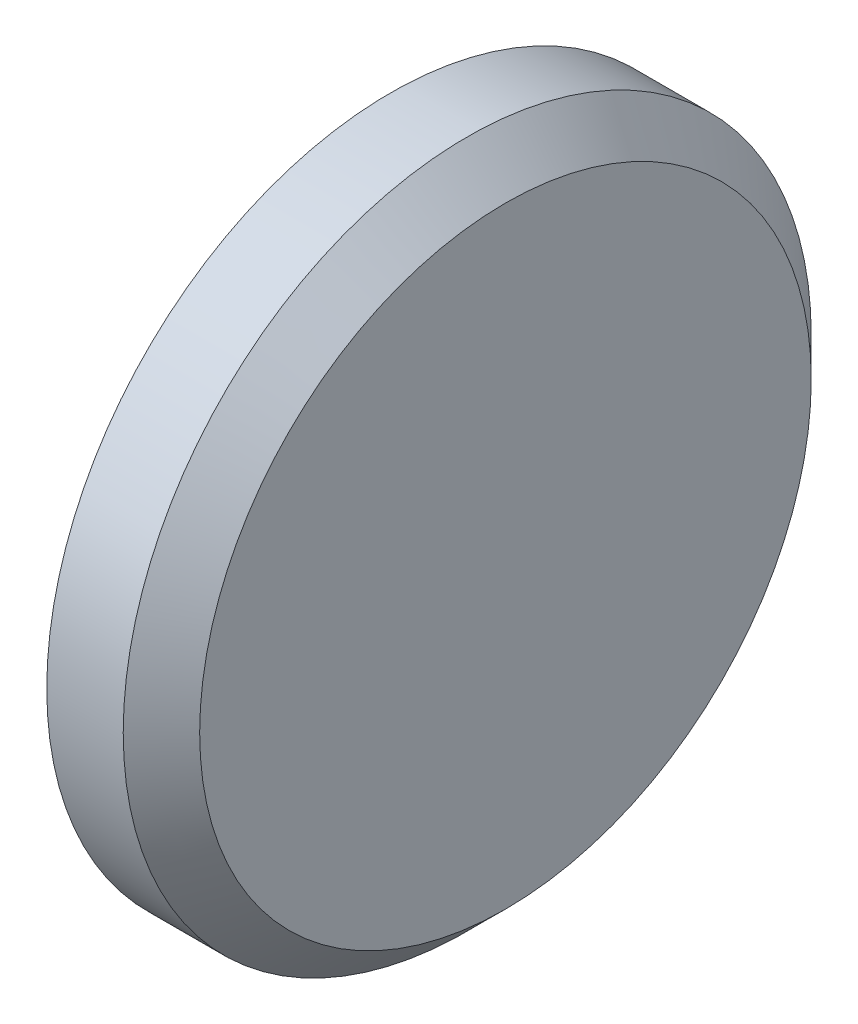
ISO-10303-21;
HEADER;
FILE_DESCRIPTION(('STEP AP214'),'2;1');
FILE_NAME('part.step','',(''),(''),'','','');
FILE_SCHEMA(('AUTOMOTIVE_DESIGN { 1 0 10303 214 1 1 1 1 }'));
ENDSEC;
DATA;
#1=APPLICATION_CONTEXT('core data for automotive mechanical design processes');
#2=APPLICATION_PROTOCOL_DEFINITION('international standard','automotive_design',2000,#1);
#3=PRODUCT_CONTEXT('',#1,'mechanical');
#4=PRODUCT('Part','Part','',(#3));
#5=PRODUCT_RELATED_PRODUCT_CATEGORY('part','',(#4));
#6=PRODUCT_DEFINITION_FORMATION('','',#4);
#7=PRODUCT_DEFINITION_CONTEXT('part definition',#1,'design');
#8=PRODUCT_DEFINITION('design','',#6,#7);
#9=PRODUCT_DEFINITION_SHAPE('','',#8);
#10=(LENGTH_UNIT() NAMED_UNIT(*) SI_UNIT(.MILLI.,.METRE.));
#11=(NAMED_UNIT(*) PLANE_ANGLE_UNIT() SI_UNIT($,.RADIAN.));
#12=(NAMED_UNIT(*) SI_UNIT($,.STERADIAN.) SOLID_ANGLE_UNIT());
#13=UNCERTAINTY_MEASURE_WITH_UNIT(LENGTH_MEASURE(1.E-05),#10,'distance_accuracy_value','');
#14=(GEOMETRIC_REPRESENTATION_CONTEXT(3) GLOBAL_UNCERTAINTY_ASSIGNED_CONTEXT((#13)) GLOBAL_UNIT_ASSIGNED_CONTEXT((#10,
#11,#12)) REPRESENTATION_CONTEXT('',''));
#15=CARTESIAN_POINT('',(0.,0.,0.));
#16=DIRECTION('',(0.,0.,1.));
#17=DIRECTION('',(1.,0.,0.));
#18=AXIS2_PLACEMENT_3D('',#15,#16,#17);
#19=CARTESIAN_POINT('',(3.,0.,0.));
#20=DIRECTION('',(-1.,0.,0.));
#21=DIRECTION('',(0.,0.,1.));
#22=AXIS2_PLACEMENT_3D('',#19,#20,#21);
#23=CYLINDRICAL_SURFACE('',#22,9.);
#24=CARTESIAN_POINT('',(1.99999999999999,0.,0.));
#25=DIRECTION('',(1.,0.,0.));
#26=DIRECTION('',(0.,0.,-1.));
#27=AXIS2_PLACEMENT_3D('',#24,#25,#26);
#28=CIRCLE('',#27,9.);
#29=CARTESIAN_POINT('',(1.99999999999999,0.,-9.));
#30=VERTEX_POINT('',#29);
#31=EDGE_CURVE('E10',#30,#30,#28,.F.);
#32=ORIENTED_EDGE('',*,*,#31,.T.);
#33=EDGE_LOOP('',(#32));
#34=FACE_BOUND('',#33,.T.);
#35=CARTESIAN_POINT('',(0.,0.,0.));
#36=DIRECTION('',(1.,0.,0.));
#37=DIRECTION('',(0.,0.,-1.));
#38=AXIS2_PLACEMENT_3D('',#35,#36,#37);
#39=CIRCLE('',#38,9.);
#40=CARTESIAN_POINT('',(0.,0.,-9.));
#41=VERTEX_POINT('',#40);
#42=EDGE_CURVE('E42',#41,#41,#39,.T.);
#43=ORIENTED_EDGE('',*,*,#42,.T.);
#44=EDGE_LOOP('',(#43));
#45=FACE_BOUND('',#44,.T.);
#46=ADVANCED_FACE('F31',(#34,#45),#23,.T.);
#47=CARTESIAN_POINT('',(3.,0.,0.));
#48=DIRECTION('',(1.,0.,0.));
#49=DIRECTION('',(0.,0.,-1.));
#50=AXIS2_PLACEMENT_3D('',#47,#48,#49);
#51=PLANE('',#50);
#52=CARTESIAN_POINT('',(3.,0.,0.));
#53=DIRECTION('',(1.,0.,0.));
#54=DIRECTION('',(0.,0.,-1.));
#55=AXIS2_PLACEMENT_3D('',#52,#53,#54);
#56=CIRCLE('',#55,8.);
#57=CARTESIAN_POINT('',(3.,0.,-8.));
#58=VERTEX_POINT('',#57);
#59=EDGE_CURVE('E38',#58,#58,#56,.T.);
#60=ORIENTED_EDGE('',*,*,#59,.T.);
#61=EDGE_LOOP('',(#60));
#62=FACE_BOUND('',#61,.T.);
#63=ADVANCED_FACE('F52',(#62),#51,.T.);
#64=CARTESIAN_POINT('',(0.,0.,0.));
#65=DIRECTION('',(1.,0.,0.));
#66=DIRECTION('',(0.,0.,-1.));
#67=AXIS2_PLACEMENT_3D('',#64,#65,#66);
#68=PLANE('',#67);
#69=ORIENTED_EDGE('',*,*,#42,.F.);
#70=EDGE_LOOP('',(#69));
#71=FACE_BOUND('',#70,.T.);
#72=ADVANCED_FACE('F50',(#71),#68,.F.);
#73=CARTESIAN_POINT('',(3.,0.,0.));
#74=DIRECTION('',(-1.,0.,0.));
#75=DIRECTION('',(0.,0.,1.));
#76=AXIS2_PLACEMENT_3D('',#73,#74,#75);
#77=CONICAL_SURFACE('',#76,8.,0.785398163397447);
#78=ORIENTED_EDGE('',*,*,#31,.F.);
#79=EDGE_LOOP('',(#78));
#80=FACE_BOUND('',#79,.T.);
#81=ORIENTED_EDGE('',*,*,#59,.F.);
#82=EDGE_LOOP('',(#81));
#83=FACE_BOUND('',#82,.T.);
#84=ADVANCED_FACE('F33',(#80,#83),#77,.T.);
#85=CLOSED_SHELL('',(#46,#63,#72,#84));
#86=MANIFOLD_SOLID_BREP('B2',#85);
#87=ADVANCED_BREP_SHAPE_REPRESENTATION('',(#18,#86),#14);
#88=SHAPE_DEFINITION_REPRESENTATION(#9,#87);
ENDSEC;
END-ISO-10303-21;
